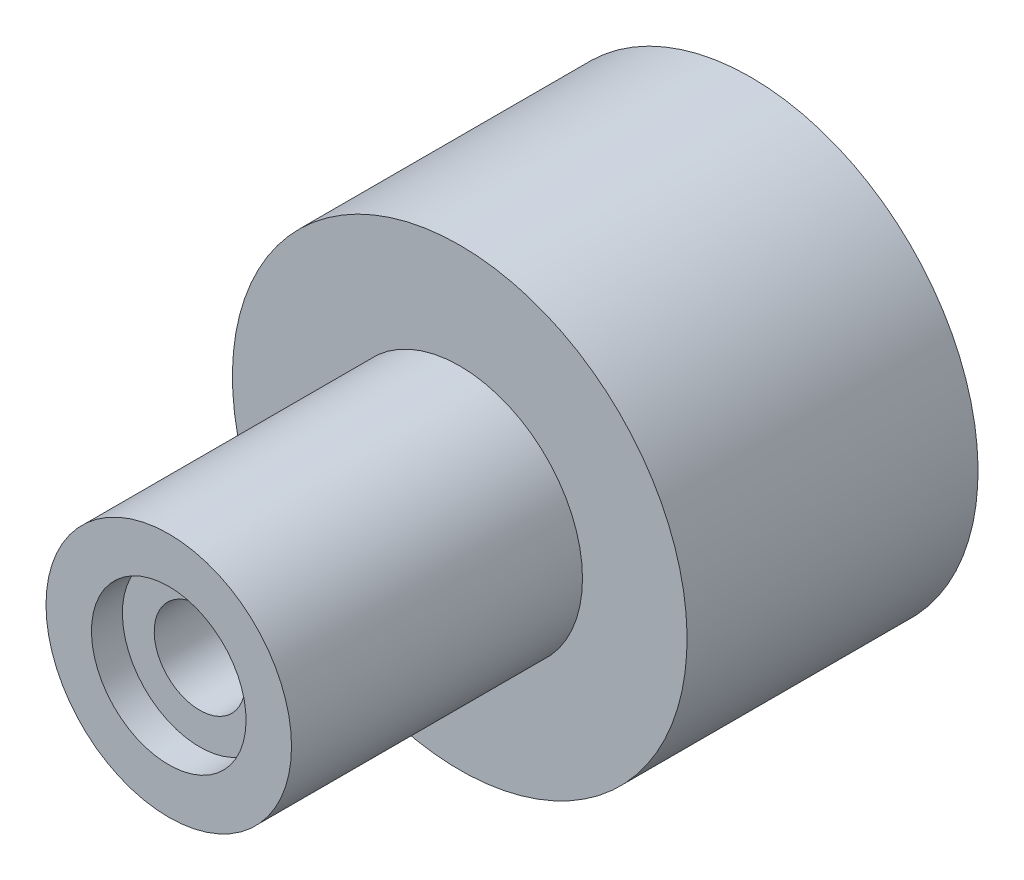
ISO-10303-21;
HEADER;
FILE_DESCRIPTION(('STEP AP214'),'2;1');
FILE_NAME('part.step','',(''),(''),'','','');
FILE_SCHEMA(('AUTOMOTIVE_DESIGN { 1 0 10303 214 1 1 1 1 }'));
ENDSEC;
DATA;
#1=APPLICATION_CONTEXT('core data for automotive mechanical design processes');
#2=APPLICATION_PROTOCOL_DEFINITION('international standard','automotive_design',2000,#1);
#3=PRODUCT_CONTEXT('',#1,'mechanical');
#4=PRODUCT('Part','Part','',(#3));
#5=PRODUCT_RELATED_PRODUCT_CATEGORY('part','',(#4));
#6=PRODUCT_DEFINITION_FORMATION('','',#4);
#7=PRODUCT_DEFINITION_CONTEXT('part definition',#1,'design');
#8=PRODUCT_DEFINITION('design','',#6,#7);
#9=PRODUCT_DEFINITION_SHAPE('','',#8);
#10=(LENGTH_UNIT() NAMED_UNIT(*) SI_UNIT(.MILLI.,.METRE.));
#11=(NAMED_UNIT(*) PLANE_ANGLE_UNIT() SI_UNIT($,.RADIAN.));
#12=(NAMED_UNIT(*) SI_UNIT($,.STERADIAN.) SOLID_ANGLE_UNIT());
#13=UNCERTAINTY_MEASURE_WITH_UNIT(LENGTH_MEASURE(1.E-05),#10,'distance_accuracy_value','');
#14=(GEOMETRIC_REPRESENTATION_CONTEXT(3) GLOBAL_UNCERTAINTY_ASSIGNED_CONTEXT((#13)) GLOBAL_UNIT_ASSIGNED_CONTEXT((#10,
#11,#12)) REPRESENTATION_CONTEXT('',''));
#15=CARTESIAN_POINT('',(0.,0.,0.));
#16=DIRECTION('',(0.,0.,1.));
#17=DIRECTION('',(1.,0.,0.));
#18=AXIS2_PLACEMENT_3D('',#15,#16,#17);
#19=CARTESIAN_POINT('',(0.,0.,0.));
#20=DIRECTION('',(0.,0.,-1.));
#21=DIRECTION('',(0.,1.,0.));
#22=AXIS2_PLACEMENT_3D('',#19,#20,#21);
#23=CYLINDRICAL_SURFACE('',#22,12.5);
#24=CARTESIAN_POINT('',(0.,0.,16.));
#25=DIRECTION('',(0.,0.,-1.));
#26=DIRECTION('',(0.,1.,0.));
#27=AXIS2_PLACEMENT_3D('',#24,#25,#26);
#28=CIRCLE('',#27,12.5);
#29=CARTESIAN_POINT('',(0.,12.5,16.));
#30=VERTEX_POINT('',#29);
#31=EDGE_CURVE('E41',#30,#30,#28,.T.);
#32=ORIENTED_EDGE('',*,*,#31,.T.);
#33=EDGE_LOOP('',(#32));
#34=FACE_BOUND('',#33,.T.);
#35=CARTESIAN_POINT('',(0.,0.,0.));
#36=DIRECTION('',(0.,0.,-1.));
#37=DIRECTION('',(0.,1.,0.));
#38=AXIS2_PLACEMENT_3D('',#35,#36,#37);
#39=CIRCLE('',#38,12.5);
#40=CARTESIAN_POINT('',(0.,12.5,0.));
#41=VERTEX_POINT('',#40);
#42=EDGE_CURVE('E44',#41,#41,#39,.T.);
#43=ORIENTED_EDGE('',*,*,#42,.F.);
#44=EDGE_LOOP('',(#43));
#45=FACE_BOUND('',#44,.T.);
#46=ADVANCED_FACE('F12',(#34,#45),#23,.T.);
#47=CARTESIAN_POINT('',(0.,0.,0.));
#48=DIRECTION('',(0.,0.,-1.));
#49=DIRECTION('',(0.,1.,0.));
#50=AXIS2_PLACEMENT_3D('',#47,#48,#49);
#51=CYLINDRICAL_SURFACE('',#50,2.5);
#52=CARTESIAN_POINT('',(0.,0.,12.));
#53=DIRECTION('',(0.,0.,-1.));
#54=DIRECTION('',(0.,1.,0.));
#55=AXIS2_PLACEMENT_3D('',#52,#53,#54);
#56=CIRCLE('',#55,2.5);
#57=CARTESIAN_POINT('',(0.,2.5,12.));
#58=VERTEX_POINT('',#57);
#59=EDGE_CURVE('E19',#58,#58,#56,.T.);
#60=ORIENTED_EDGE('',*,*,#59,.T.);
#61=EDGE_LOOP('',(#60));
#62=FACE_BOUND('',#61,.T.);
#63=CARTESIAN_POINT('',(0.,0.,30.3));
#64=DIRECTION('',(0.,0.,-1.));
#65=DIRECTION('',(0.,1.,0.));
#66=AXIS2_PLACEMENT_3D('',#63,#64,#65);
#67=CIRCLE('',#66,2.5);
#68=CARTESIAN_POINT('',(0.,2.5,30.3));
#69=VERTEX_POINT('',#68);
#70=EDGE_CURVE('E23',#69,#69,#67,.T.);
#71=ORIENTED_EDGE('',*,*,#70,.F.);
#72=EDGE_LOOP('',(#71));
#73=FACE_BOUND('',#72,.T.);
#74=ADVANCED_FACE('F103',(#62,#73),#51,.F.);
#75=CARTESIAN_POINT('',(0.,0.,0.));
#76=DIRECTION('',(0.,0.,-1.));
#77=DIRECTION('',(0.,1.,0.));
#78=AXIS2_PLACEMENT_3D('',#75,#76,#77);
#79=CYLINDRICAL_SURFACE('',#78,4.);
#80=CARTESIAN_POINT('',(0.,0.,0.));
#81=DIRECTION('',(0.,0.,-1.));
#82=DIRECTION('',(0.,1.,0.));
#83=AXIS2_PLACEMENT_3D('',#80,#81,#82);
#84=CIRCLE('',#83,4.);
#85=CARTESIAN_POINT('',(0.,4.,0.));
#86=VERTEX_POINT('',#85);
#87=EDGE_CURVE('E47',#86,#86,#84,.T.);
#88=ORIENTED_EDGE('',*,*,#87,.T.);
#89=EDGE_LOOP('',(#88));
#90=FACE_BOUND('',#89,.T.);
#91=CARTESIAN_POINT('',(0.,0.,12.));
#92=DIRECTION('',(0.,0.,-1.));
#93=DIRECTION('',(0.,1.,0.));
#94=AXIS2_PLACEMENT_3D('',#91,#92,#93);
#95=CIRCLE('',#94,4.);
#96=CARTESIAN_POINT('',(0.,4.,12.));
#97=VERTEX_POINT('',#96);
#98=EDGE_CURVE('E8',#97,#97,#95,.T.);
#99=ORIENTED_EDGE('',*,*,#98,.F.);
#100=EDGE_LOOP('',(#99));
#101=FACE_BOUND('',#100,.T.);
#102=ADVANCED_FACE('F14',(#90,#101),#79,.F.);
#103=CARTESIAN_POINT('',(2.5,0.,12.));
#104=DIRECTION('',(0.,0.,-1.));
#105=DIRECTION('',(0.,1.,0.));
#106=AXIS2_PLACEMENT_3D('',#103,#104,#105);
#107=PLANE('',#106);
#108=ORIENTED_EDGE('',*,*,#98,.T.);
#109=EDGE_LOOP('',(#108));
#110=FACE_BOUND('',#109,.T.);
#111=ORIENTED_EDGE('',*,*,#59,.F.);
#112=EDGE_LOOP('',(#111));
#113=FACE_BOUND('',#112,.T.);
#114=ADVANCED_FACE('F102',(#110,#113),#107,.T.);
#115=CARTESIAN_POINT('',(4.25,0.,30.3));
#116=DIRECTION('',(0.,0.,1.));
#117=DIRECTION('',(0.,-1.,0.));
#118=AXIS2_PLACEMENT_3D('',#115,#116,#117);
#119=PLANE('',#118);
#120=ORIENTED_EDGE('',*,*,#70,.T.);
#121=EDGE_LOOP('',(#120));
#122=FACE_BOUND('',#121,.T.);
#123=CARTESIAN_POINT('',(0.,0.,30.3));
#124=DIRECTION('',(0.,0.,-1.));
#125=DIRECTION('',(0.,1.,0.));
#126=AXIS2_PLACEMENT_3D('',#123,#124,#125);
#127=CIRCLE('',#126,4.25);
#128=CARTESIAN_POINT('',(0.,4.25,30.3));
#129=VERTEX_POINT('',#128);
#130=EDGE_CURVE('E27',#129,#129,#127,.T.);
#131=ORIENTED_EDGE('',*,*,#130,.F.);
#132=EDGE_LOOP('',(#131));
#133=FACE_BOUND('',#132,.T.);
#134=ADVANCED_FACE('F110',(#122,#133),#119,.T.);
#135=CARTESIAN_POINT('',(0.,0.,0.));
#136=DIRECTION('',(0.,0.,-1.));
#137=DIRECTION('',(0.,1.,0.));
#138=AXIS2_PLACEMENT_3D('',#135,#136,#137);
#139=CYLINDRICAL_SURFACE('',#138,4.25);
#140=ORIENTED_EDGE('',*,*,#130,.T.);
#141=EDGE_LOOP('',(#140));
#142=FACE_BOUND('',#141,.T.);
#143=CARTESIAN_POINT('',(0.,0.,32.));
#144=DIRECTION('',(0.,0.,-1.));
#145=DIRECTION('',(0.,1.,0.));
#146=AXIS2_PLACEMENT_3D('',#143,#144,#145);
#147=CIRCLE('',#146,4.25);
#148=CARTESIAN_POINT('',(0.,4.25,32.));
#149=VERTEX_POINT('',#148);
#150=EDGE_CURVE('E32',#149,#149,#147,.T.);
#151=ORIENTED_EDGE('',*,*,#150,.F.);
#152=EDGE_LOOP('',(#151));
#153=FACE_BOUND('',#152,.T.);
#154=ADVANCED_FACE('F131',(#142,#153),#139,.F.);
#155=CARTESIAN_POINT('',(4.25,0.,32.));
#156=DIRECTION('',(0.,0.,1.));
#157=DIRECTION('',(0.,-1.,0.));
#158=AXIS2_PLACEMENT_3D('',#155,#156,#157);
#159=PLANE('',#158);
#160=ORIENTED_EDGE('',*,*,#150,.T.);
#161=EDGE_LOOP('',(#160));
#162=FACE_BOUND('',#161,.T.);
#163=CARTESIAN_POINT('',(0.,0.,32.));
#164=DIRECTION('',(0.,0.,-1.));
#165=DIRECTION('',(0.,1.,0.));
#166=AXIS2_PLACEMENT_3D('',#163,#164,#165);
#167=CIRCLE('',#166,6.75);
#168=CARTESIAN_POINT('',(0.,6.75,32.));
#169=VERTEX_POINT('',#168);
#170=EDGE_CURVE('E35',#169,#169,#167,.T.);
#171=ORIENTED_EDGE('',*,*,#170,.F.);
#172=EDGE_LOOP('',(#171));
#173=FACE_BOUND('',#172,.T.);
#174=ADVANCED_FACE('F127',(#162,#173),#159,.T.);
#175=CARTESIAN_POINT('',(0.,0.,0.));
#176=DIRECTION('',(0.,0.,-1.));
#177=DIRECTION('',(0.,1.,0.));
#178=AXIS2_PLACEMENT_3D('',#175,#176,#177);
#179=CYLINDRICAL_SURFACE('',#178,6.75);
#180=ORIENTED_EDGE('',*,*,#170,.T.);
#181=EDGE_LOOP('',(#180));
#182=FACE_BOUND('',#181,.T.);
#183=CARTESIAN_POINT('',(0.,0.,16.));
#184=DIRECTION('',(0.,0.,-1.));
#185=DIRECTION('',(0.,1.,0.));
#186=AXIS2_PLACEMENT_3D('',#183,#184,#185);
#187=CIRCLE('',#186,6.75);
#188=CARTESIAN_POINT('',(0.,6.75,16.));
#189=VERTEX_POINT('',#188);
#190=EDGE_CURVE('E38',#189,#189,#187,.T.);
#191=ORIENTED_EDGE('',*,*,#190,.F.);
#192=EDGE_LOOP('',(#191));
#193=FACE_BOUND('',#192,.T.);
#194=ADVANCED_FACE('F123',(#182,#193),#179,.T.);
#195=CARTESIAN_POINT('',(6.75,0.,16.));
#196=DIRECTION('',(0.,0.,1.));
#197=DIRECTION('',(0.,-1.,0.));
#198=AXIS2_PLACEMENT_3D('',#195,#196,#197);
#199=PLANE('',#198);
#200=ORIENTED_EDGE('',*,*,#190,.T.);
#201=EDGE_LOOP('',(#200));
#202=FACE_BOUND('',#201,.T.);
#203=ORIENTED_EDGE('',*,*,#31,.F.);
#204=EDGE_LOOP('',(#203));
#205=FACE_BOUND('',#204,.T.);
#206=ADVANCED_FACE('F88',(#202,#205),#199,.T.);
#207=CARTESIAN_POINT('',(12.5,0.,0.));
#208=DIRECTION('',(0.,0.,-1.));
#209=DIRECTION('',(0.,1.,0.));
#210=AXIS2_PLACEMENT_3D('',#207,#208,#209);
#211=PLANE('',#210);
#212=CARTESIAN_POINT('',(6.363961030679,6.36396103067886,0.));
#213=DIRECTION('',(0.,0.,-1.));
#214=DIRECTION('',(0.,1.,0.));
#215=AXIS2_PLACEMENT_3D('',#212,#213,#214);
#216=CIRCLE('',#215,2.);
#217=CARTESIAN_POINT('',(6.363961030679,8.36396103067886,0.));
#218=VERTEX_POINT('',#217);
#219=EDGE_CURVE('E68',#218,#218,#216,.T.);
#220=ORIENTED_EDGE('',*,*,#219,.F.);
#221=EDGE_LOOP('',(#220));
#222=FACE_BOUND('',#221,.T.);
#223=CARTESIAN_POINT('',(-6.36396103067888,6.36396103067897,0.));
#224=DIRECTION('',(0.,0.,-1.));
#225=DIRECTION('',(0.,1.,0.));
#226=AXIS2_PLACEMENT_3D('',#223,#224,#225);
#227=CIRCLE('',#226,2.);
#228=CARTESIAN_POINT('',(-6.36396103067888,8.36396103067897,0.));
#229=VERTEX_POINT('',#228);
#230=EDGE_CURVE('E62',#229,#229,#227,.T.);
#231=ORIENTED_EDGE('',*,*,#230,.F.);
#232=EDGE_LOOP('',(#231));
#233=FACE_BOUND('',#232,.T.);
#234=CARTESIAN_POINT('',(-6.36396103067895,-6.36396103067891,0.));
#235=DIRECTION('',(0.,0.,-1.));
#236=DIRECTION('',(0.,1.,0.));
#237=AXIS2_PLACEMENT_3D('',#234,#235,#236);
#238=CIRCLE('',#237,2.);
#239=CARTESIAN_POINT('',(-6.36396103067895,-4.36396103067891,0.));
#240=VERTEX_POINT('',#239);
#241=EDGE_CURVE('E56',#240,#240,#238,.T.);
#242=ORIENTED_EDGE('',*,*,#241,.F.);
#243=EDGE_LOOP('',(#242));
#244=FACE_BOUND('',#243,.T.);
#245=CARTESIAN_POINT('',(6.36396103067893,-6.36396103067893,0.));
#246=DIRECTION('',(0.,0.,-1.));
#247=DIRECTION('',(0.,1.,0.));
#248=AXIS2_PLACEMENT_3D('',#245,#246,#247);
#249=CIRCLE('',#248,2.);
#250=CARTESIAN_POINT('',(6.36396103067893,-4.36396103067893,0.));
#251=VERTEX_POINT('',#250);
#252=EDGE_CURVE('E50',#251,#251,#249,.T.);
#253=ORIENTED_EDGE('',*,*,#252,.F.);
#254=EDGE_LOOP('',(#253));
#255=FACE_BOUND('',#254,.T.);
#256=ORIENTED_EDGE('',*,*,#42,.T.);
#257=EDGE_LOOP('',(#256));
#258=FACE_BOUND('',#257,.T.);
#259=ORIENTED_EDGE('',*,*,#87,.F.);
#260=EDGE_LOOP('',(#259));
#261=FACE_BOUND('',#260,.T.);
#262=ADVANCED_FACE('F84',(#222,#233,#244,#255,#258,#261),#211,.T.);
#263=CARTESIAN_POINT('',(6.36396103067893,-6.36396103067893,0.));
#264=DIRECTION('',(0.,0.,-1.));
#265=DIRECTION('',(0.,1.,0.));
#266=AXIS2_PLACEMENT_3D('',#263,#264,#265);
#267=CYLINDRICAL_SURFACE('',#266,2.);
#268=CARTESIAN_POINT('',(6.36396103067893,-6.36396103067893,8.));
#269=DIRECTION('',(0.,0.,-1.));
#270=DIRECTION('',(0.,1.,0.));
#271=AXIS2_PLACEMENT_3D('',#268,#269,#270);
#272=CIRCLE('',#271,2.);
#273=CARTESIAN_POINT('',(6.36396103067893,-4.36396103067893,8.));
#274=VERTEX_POINT('',#273);
#275=EDGE_CURVE('E53',#274,#274,#272,.T.);
#276=ORIENTED_EDGE('',*,*,#275,.F.);
#277=EDGE_LOOP('',(#276));
#278=FACE_BOUND('',#277,.T.);
#279=ORIENTED_EDGE('',*,*,#252,.T.);
#280=EDGE_LOOP('',(#279));
#281=FACE_BOUND('',#280,.T.);
#282=ADVANCED_FACE('F87',(#278,#281),#267,.F.);
#283=CARTESIAN_POINT('',(8.01396103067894,-6.36396103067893,8.));
#284=DIRECTION('',(0.,0.,1.));
#285=DIRECTION('',(0.,-1.,0.));
#286=AXIS2_PLACEMENT_3D('',#283,#284,#285);
#287=PLANE('',#286);
#288=ORIENTED_EDGE('',*,*,#275,.T.);
#289=EDGE_LOOP('',(#288));
#290=FACE_BOUND('',#289,.T.);
#291=ADVANCED_FACE('F192',(#290),#287,.F.);
#292=CARTESIAN_POINT('',(-6.36396103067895,-6.36396103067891,0.));
#293=DIRECTION('',(0.,0.,-1.));
#294=DIRECTION('',(0.,1.,0.));
#295=AXIS2_PLACEMENT_3D('',#292,#293,#294);
#296=CYLINDRICAL_SURFACE('',#295,2.);
#297=CARTESIAN_POINT('',(-6.36396103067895,-6.36396103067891,8.));
#298=DIRECTION('',(0.,0.,-1.));
#299=DIRECTION('',(0.,1.,0.));
#300=AXIS2_PLACEMENT_3D('',#297,#298,#299);
#301=CIRCLE('',#300,2.);
#302=CARTESIAN_POINT('',(-6.36396103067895,-4.36396103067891,8.));
#303=VERTEX_POINT('',#302);
#304=EDGE_CURVE('E59',#303,#303,#301,.T.);
#305=ORIENTED_EDGE('',*,*,#304,.F.);
#306=EDGE_LOOP('',(#305));
#307=FACE_BOUND('',#306,.T.);
#308=ORIENTED_EDGE('',*,*,#241,.T.);
#309=EDGE_LOOP('',(#308));
#310=FACE_BOUND('',#309,.T.);
#311=ADVANCED_FACE('F200',(#307,#310),#296,.F.);
#312=CARTESIAN_POINT('',(-4.71396103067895,-6.36396103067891,8.));
#313=DIRECTION('',(0.,0.,1.));
#314=DIRECTION('',(0.,-1.,0.));
#315=AXIS2_PLACEMENT_3D('',#312,#313,#314);
#316=PLANE('',#315);
#317=ORIENTED_EDGE('',*,*,#304,.T.);
#318=EDGE_LOOP('',(#317));
#319=FACE_BOUND('',#318,.T.);
#320=ADVANCED_FACE('F209',(#319),#316,.F.);
#321=CARTESIAN_POINT('',(-6.36396103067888,6.36396103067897,0.));
#322=DIRECTION('',(0.,0.,-1.));
#323=DIRECTION('',(0.,1.,0.));
#324=AXIS2_PLACEMENT_3D('',#321,#322,#323);
#325=CYLINDRICAL_SURFACE('',#324,2.);
#326=CARTESIAN_POINT('',(-6.36396103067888,6.36396103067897,8.));
#327=DIRECTION('',(0.,0.,-1.));
#328=DIRECTION('',(0.,1.,0.));
#329=AXIS2_PLACEMENT_3D('',#326,#327,#328);
#330=CIRCLE('',#329,2.);
#331=CARTESIAN_POINT('',(-6.36396103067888,8.36396103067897,8.));
#332=VERTEX_POINT('',#331);
#333=EDGE_CURVE('E65',#332,#332,#330,.T.);
#334=ORIENTED_EDGE('',*,*,#333,.F.);
#335=EDGE_LOOP('',(#334));
#336=FACE_BOUND('',#335,.T.);
#337=ORIENTED_EDGE('',*,*,#230,.T.);
#338=EDGE_LOOP('',(#337));
#339=FACE_BOUND('',#338,.T.);
#340=ADVANCED_FACE('F218',(#336,#339),#325,.F.);
#341=CARTESIAN_POINT('',(-4.71396103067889,6.36396103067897,8.));
#342=DIRECTION('',(0.,0.,1.));
#343=DIRECTION('',(0.,-1.,0.));
#344=AXIS2_PLACEMENT_3D('',#341,#342,#343);
#345=PLANE('',#344);
#346=ORIENTED_EDGE('',*,*,#333,.T.);
#347=EDGE_LOOP('',(#346));
#348=FACE_BOUND('',#347,.T.);
#349=ADVANCED_FACE('F80',(#348),#345,.F.);
#350=CARTESIAN_POINT('',(6.363961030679,6.36396103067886,0.));
#351=DIRECTION('',(0.,0.,-1.));
#352=DIRECTION('',(0.,1.,0.));
#353=AXIS2_PLACEMENT_3D('',#350,#351,#352);
#354=CYLINDRICAL_SURFACE('',#353,2.);
#355=CARTESIAN_POINT('',(6.363961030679,6.36396103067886,8.));
#356=DIRECTION('',(0.,0.,-1.));
#357=DIRECTION('',(0.,1.,0.));
#358=AXIS2_PLACEMENT_3D('',#355,#356,#357);
#359=CIRCLE('',#358,2.);
#360=CARTESIAN_POINT('',(6.363961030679,8.36396103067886,8.));
#361=VERTEX_POINT('',#360);
#362=EDGE_CURVE('E71',#361,#361,#359,.T.);
#363=ORIENTED_EDGE('',*,*,#362,.F.);
#364=EDGE_LOOP('',(#363));
#365=FACE_BOUND('',#364,.T.);
#366=ORIENTED_EDGE('',*,*,#219,.T.);
#367=EDGE_LOOP('',(#366));
#368=FACE_BOUND('',#367,.T.);
#369=ADVANCED_FACE('F77',(#365,#368),#354,.F.);
#370=CARTESIAN_POINT('',(8.01396103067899,6.36396103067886,8.));
#371=DIRECTION('',(0.,0.,1.));
#372=DIRECTION('',(0.,-1.,0.));
#373=AXIS2_PLACEMENT_3D('',#370,#371,#372);
#374=PLANE('',#373);
#375=ORIENTED_EDGE('',*,*,#362,.T.);
#376=EDGE_LOOP('',(#375));
#377=FACE_BOUND('',#376,.T.);
#378=ADVANCED_FACE('F75',(#377),#374,.F.);
#379=CLOSED_SHELL('',(#46,#74,#102,#114,#134,#154,#174,#194,#206,#262,#282,#291,#311,#320,#340,
#349,#369,#378));
#380=MANIFOLD_SOLID_BREP('B1',#379);
#381=ADVANCED_BREP_SHAPE_REPRESENTATION('',(#18,#380),#14);
#382=SHAPE_DEFINITION_REPRESENTATION(#9,#381);
ENDSEC;
END-ISO-10303-21;
